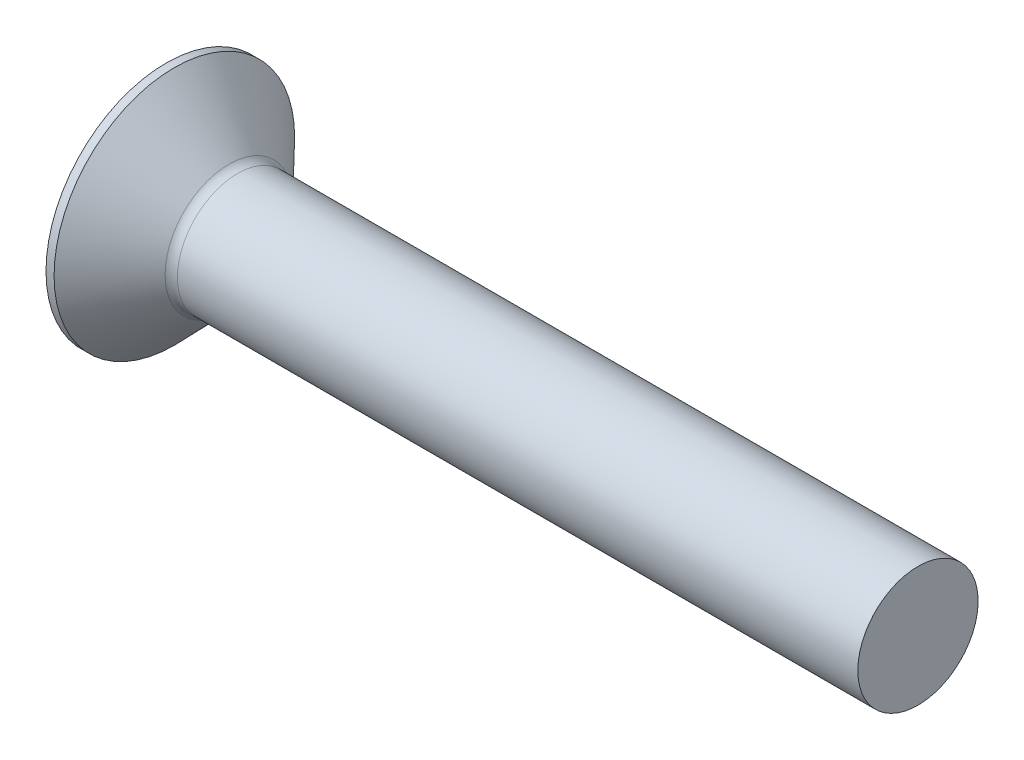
from build123d import *

# Parameters (mm, degrees)
FILLET1_R    = 0.8
RECPAT_COUNT = 2
RECPAT_ANGLE = 90


with BuildPart() as part:
    # BodySke → BaseBody (revolve)
    with BuildSketch(Plane.XY, mode=Mode.PRIVATE) as basebody_sk:
        with BuildLine():
            Line((1.8, 8), (2.337244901, 8))
            Line((2.337244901, 8), (6.2, 4))
            Line((6.2, 4), (51.8, 4))
            Line((51.8, 4), (51.8, 0))
            Line((51.8, 0), (1.8, 0))
            Line((1.8, 0), (0, 0))
            ThreePointArc((0, 0), (0.455555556, 4.1), (1.8, 8))
        make_face()
    revolve(basebody_sk.sketch.rotate(Axis((1.8, 0, 0), (1, 0, 0)), 90), axis=Axis((1.8, 0, 0), (1, 0, 0)))

    # Fillet1
    fillet1_edges = [part.edges().sort_by_distance(p)[0] for p in [
        (6.2, 0, -4),
    ]]
    fillet(fillet1_edges, radius=FILLET1_R)

    # RecSkeTop → Recess section 0
    with BuildSketch(Plane(origin=(0, 0, 0), x_dir=(0, 0, -1), z_dir=(1, 0, 0))):
        with BuildLine():
            Line((-0.946, 4.3), (0.946, 4.3))
            Line((0.946, 4.3), (0.946, -4.3))
            Line((0.946, -4.3), (-0.946, -4.3))
            Line((-0.946, -4.3), (-0.946, 4.3))
        make_face()
    # RecSkeBot → Recess section 1
    with BuildSketch(Plane(origin=(5.18, 0, 0), x_dir=(0, 0, -1), z_dir=(1, 0, 0))):
        with BuildLine():
            Line((-0.946, 1.717347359), (0.946, 1.717347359))
            Line((0.946, 1.717347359), (0.946, -1.717347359))
            Line((0.946, -1.717347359), (-0.946, -1.717347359))
            Line((-0.946, -1.717347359), (-0.946, 1.717347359))
        make_face()
    recess = loft(mode=Mode.SUBTRACT)

    # RecPat: Recess ×2 about axis
    recpat_axis = Axis((0, 0, 0), (1, 0, 0))
    for i in range(1, RECPAT_COUNT):
        add(recess.rotate(recpat_axis, i * RECPAT_ANGLE / (RECPAT_COUNT - 1)), mode=Mode.SUBTRACT)

    # RecCorSke → RecessCore (revolve, cut)
    with BuildSketch(Plane.XY, mode=Mode.PRIVATE) as recesscore_sk:
        Polygon((0, 0), (0, 2.0812), (5.18, 1.718979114), (5.738530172, 0), align=None)
    revolve(recesscore_sk.sketch.rotate(Axis((0, 0, 0), (1, 0, 0)), 90), axis=Axis((0, 0, 0), (1, 0, 0)), mode=Mode.SUBTRACT)


solid = part.part
